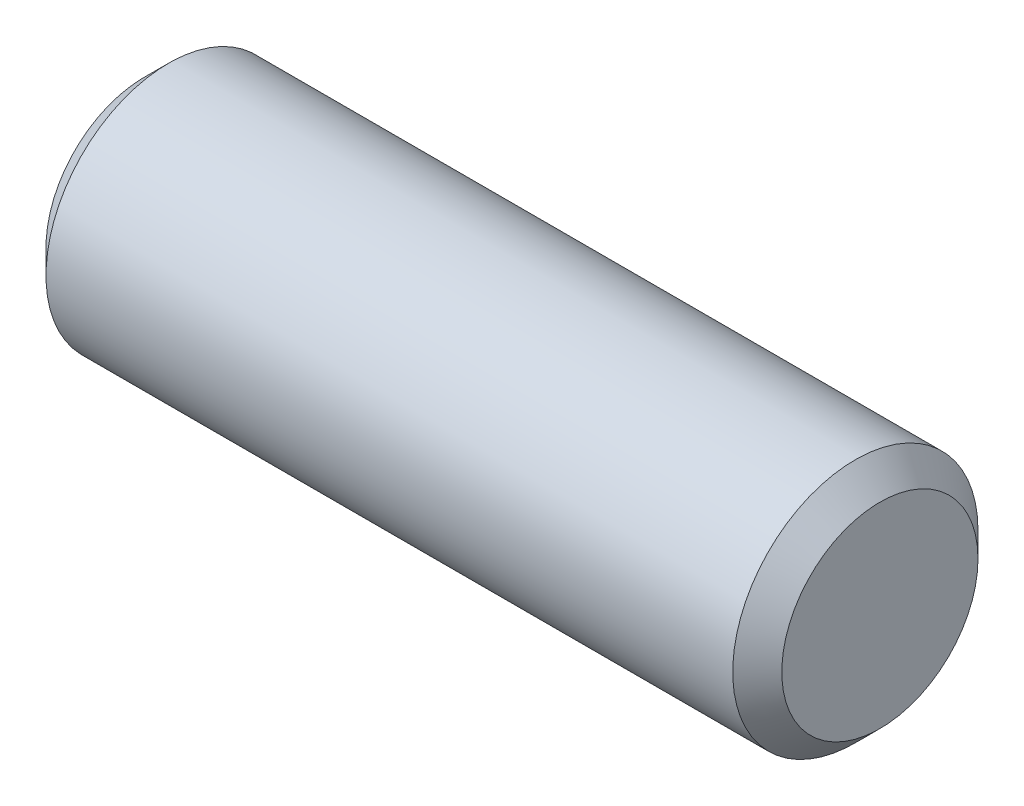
from build123d import *

# Parameters (mm, degrees)
EXTRUDE1_DEPTH      = 4.7625
EXTRUDE1_DEPTH_BACK = 4.7625
SKETCH2_R           = 1.5875
CHAMFER1_SIZE       = 0.3175


with BuildPart() as part:
    # Sketch2 → Extrude1 (new, two sides: drawn at the far end of the back side and taken through both)
    with BuildSketch(Plane(origin=(0, 0, 0), x_dir=(0, 0, -1), z_dir=(1, 0, 0)).offset(-EXTRUDE1_DEPTH_BACK)):
        Circle(SKETCH2_R)
    extrude(amount=EXTRUDE1_DEPTH + EXTRUDE1_DEPTH_BACK)

    # Chamfer1
    chamfer1_edges = [part.edges().sort_by_distance(p)[0] for p in [
        (-4.7625, 0, 1.5875),
        (4.7625, 0, 1.5875),
    ]]
    chamfer(chamfer1_edges, length=CHAMFER1_SIZE)


solid = part.part
